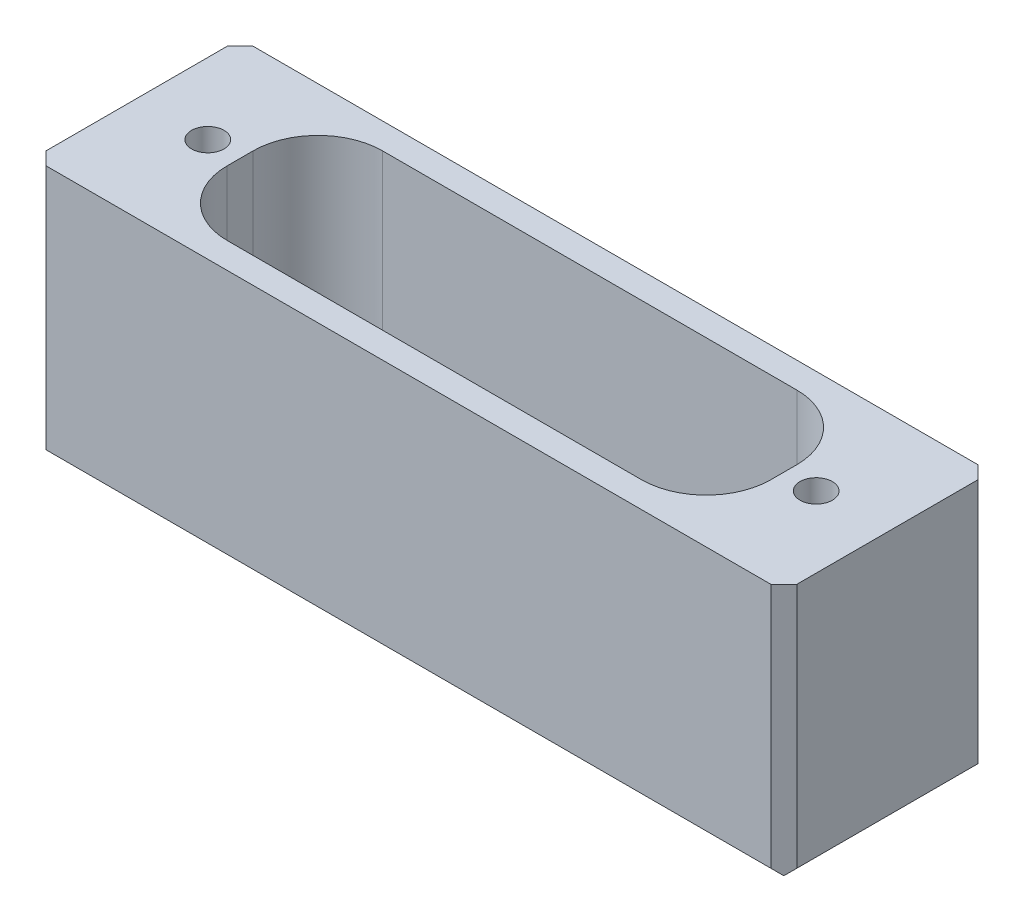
ISO-10303-21;
HEADER;
FILE_DESCRIPTION(('STEP AP214'),'2;1');
FILE_NAME('part.step','',(''),(''),'','','');
FILE_SCHEMA(('AUTOMOTIVE_DESIGN { 1 0 10303 214 1 1 1 1 }'));
ENDSEC;
DATA;
#1=APPLICATION_CONTEXT('core data for automotive mechanical design processes');
#2=APPLICATION_PROTOCOL_DEFINITION('international standard','automotive_design',2000,#1);
#3=PRODUCT_CONTEXT('',#1,'mechanical');
#4=PRODUCT('Part','Part','',(#3));
#5=PRODUCT_RELATED_PRODUCT_CATEGORY('part','',(#4));
#6=PRODUCT_DEFINITION_FORMATION('','',#4);
#7=PRODUCT_DEFINITION_CONTEXT('part definition',#1,'design');
#8=PRODUCT_DEFINITION('design','',#6,#7);
#9=PRODUCT_DEFINITION_SHAPE('','',#8);
#10=(LENGTH_UNIT() NAMED_UNIT(*) SI_UNIT(.MILLI.,.METRE.));
#11=(NAMED_UNIT(*) PLANE_ANGLE_UNIT() SI_UNIT($,.RADIAN.));
#12=(NAMED_UNIT(*) SI_UNIT($,.STERADIAN.) SOLID_ANGLE_UNIT());
#13=UNCERTAINTY_MEASURE_WITH_UNIT(LENGTH_MEASURE(1.E-05),#10,'distance_accuracy_value','');
#14=(GEOMETRIC_REPRESENTATION_CONTEXT(3) GLOBAL_UNCERTAINTY_ASSIGNED_CONTEXT((#13)) GLOBAL_UNIT_ASSIGNED_CONTEXT((#10,
#11,#12)) REPRESENTATION_CONTEXT('',''));
#15=CARTESIAN_POINT('',(0.,0.,0.));
#16=DIRECTION('',(0.,0.,1.));
#17=DIRECTION('',(1.,0.,0.));
#18=AXIS2_PLACEMENT_3D('',#15,#16,#17);
#19=CARTESIAN_POINT('',(8.,0.,-7.));
#20=DIRECTION('',(-1.,0.,0.));
#21=DIRECTION('',(0.,0.,1.));
#22=AXIS2_PLACEMENT_3D('',#19,#20,#21);
#23=PLANE('',#22);
#24=DIRECTION('',(0.,0.,-1.));
#25=VECTOR('',#24,1.);
#26=CARTESIAN_POINT('',(8.,-18.,0.));
#27=LINE('',#26,#25);
#28=CARTESIAN_POINT('',(8.,-18.,-7.));
#29=VERTEX_POINT('',#28);
#30=CARTESIAN_POINT('',(8.,-18.,-9.));
#31=VERTEX_POINT('',#30);
#32=EDGE_CURVE('P0_E172',#29,#31,#27,.T.);
#33=ORIENTED_EDGE('',*,*,#32,.T.);
#34=DIRECTION('',(0.,1.,0.));
#35=VECTOR('',#34,1.);
#36=CARTESIAN_POINT('',(8.,0.,-9.));
#37=LINE('',#36,#35);
#38=CARTESIAN_POINT('',(8.,-16.2912878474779,-9.));
#39=VERTEX_POINT('',#38);
#40=EDGE_CURVE('P0_E168',#39,#31,#37,.F.);
#41=ORIENTED_EDGE('',*,*,#40,.F.);
#42=CARTESIAN_POINT('',(8.,-14.,-8.));
#43=DIRECTION('',(-1.,0.,0.));
#44=DIRECTION('',(0.,0.,1.));
#45=AXIS2_PLACEMENT_3D('',#42,#43,#44);
#46=CIRCLE('',#45,2.5);
#47=CARTESIAN_POINT('',(8.,-16.2912878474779,-7.));
#48=VERTEX_POINT('',#47);
#49=EDGE_CURVE('P0_E19',#39,#48,#46,.T.);
#50=ORIENTED_EDGE('',*,*,#49,.T.);
#51=DIRECTION('',(0.,1.,0.));
#52=VECTOR('',#51,1.);
#53=CARTESIAN_POINT('',(8.,0.,-7.));
#54=LINE('',#53,#52);
#55=EDGE_CURVE('P0_E176',#29,#48,#54,.T.);
#56=ORIENTED_EDGE('',*,*,#55,.F.);
#57=EDGE_LOOP('',(#33,#41,#50,#56));
#58=FACE_BOUND('',#57,.T.);
#59=ADVANCED_FACE('P0_F16',(#58),#23,.F.);
#60=CARTESIAN_POINT('',(58.,-19.,-1.));
#61=DIRECTION('',(-0.707106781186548,0.707106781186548,0.));
#62=DIRECTION('',(-0.707106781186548,-0.707106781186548,0.));
#63=AXIS2_PLACEMENT_3D('',#60,#61,#62);
#64=PLANE('',#63);
#65=DIRECTION('',(0.577350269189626,0.577350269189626,0.577350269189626));
#66=VECTOR('',#65,1.);
#67=CARTESIAN_POINT('',(57.,-20.,-1.));
#68=LINE('',#67,#66);
#69=CARTESIAN_POINT('',(57.,-20.,-0.999999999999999));
#70=VERTEX_POINT('',#69);
#71=CARTESIAN_POINT('',(57.5,-19.5,-0.5));
#72=VERTEX_POINT('',#71);
#73=EDGE_CURVE('P0_E369',#70,#72,#68,.T.);
#74=ORIENTED_EDGE('',*,*,#73,.F.);
#75=DIRECTION('',(0.,0.,-1.));
#76=VECTOR('',#75,1.);
#77=CARTESIAN_POINT('',(57.,-20.,0.));
#78=LINE('',#77,#76);
#79=CARTESIAN_POINT('',(57.,-20.,-15.));
#80=VERTEX_POINT('',#79);
#81=EDGE_CURVE('P0_E328',#80,#70,#78,.F.);
#82=ORIENTED_EDGE('',*,*,#81,.F.);
#83=DIRECTION('',(-0.577350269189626,-0.577350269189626,0.577350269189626));
#84=VECTOR('',#83,1.);
#85=CARTESIAN_POINT('',(57.5,-19.5,-15.5));
#86=LINE('',#85,#84);
#87=CARTESIAN_POINT('',(57.5,-19.5,-15.5));
#88=VERTEX_POINT('',#87);
#89=EDGE_CURVE('P0_E353',#88,#80,#86,.T.);
#90=ORIENTED_EDGE('',*,*,#89,.F.);
#91=DIRECTION('',(0.577350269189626,0.577350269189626,0.577350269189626));
#92=VECTOR('',#91,1.);
#93=CARTESIAN_POINT('',(57.5,-19.5,-15.5));
#94=LINE('',#93,#92);
#95=CARTESIAN_POINT('',(58.,-19.,-15.));
#96=VERTEX_POINT('',#95);
#97=EDGE_CURVE('P0_E363',#88,#96,#94,.T.);
#98=ORIENTED_EDGE('',*,*,#97,.T.);
#99=DIRECTION('',(0.,0.,-1.));
#100=VECTOR('',#99,1.);
#101=CARTESIAN_POINT('',(58.,-19.,0.));
#102=LINE('',#101,#100);
#103=CARTESIAN_POINT('',(58.,-19.,-1.));
#104=VERTEX_POINT('',#103);
#105=EDGE_CURVE('P0_E322',#104,#96,#102,.T.);
#106=ORIENTED_EDGE('',*,*,#105,.F.);
#107=DIRECTION('',(0.577350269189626,0.577350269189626,-0.577350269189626));
#108=VECTOR('',#107,1.);
#109=CARTESIAN_POINT('',(57.5,-19.5,-0.5));
#110=LINE('',#109,#108);
#111=EDGE_CURVE('P0_E367',#72,#104,#110,.T.);
#112=ORIENTED_EDGE('',*,*,#111,.F.);
#113=EDGE_LOOP('',(#74,#82,#90,#98,#106,#112));
#114=FACE_BOUND('',#113,.T.);
#115=ADVANCED_FACE('P0_F454',(#114),#64,.F.);
#116=CARTESIAN_POINT('',(58.,-20.,-15.));
#117=DIRECTION('',(-0.707106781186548,0.,0.707106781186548));
#118=DIRECTION('',(0.707106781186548,0.,0.707106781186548));
#119=AXIS2_PLACEMENT_3D('',#116,#117,#118);
#120=PLANE('',#119);
#121=DIRECTION('',(0.577350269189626,-0.577350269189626,0.577350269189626));
#122=VECTOR('',#121,1.);
#123=CARTESIAN_POINT('',(57.,-19.,-16.));
#124=LINE('',#123,#122);
#125=CARTESIAN_POINT('',(57.,-19.,-16.));
#126=VERTEX_POINT('',#125);
#127=EDGE_CURVE('P0_E360',#126,#88,#124,.T.);
#128=ORIENTED_EDGE('',*,*,#127,.F.);
#129=DIRECTION('',(0.,1.,0.));
#130=VECTOR('',#129,1.);
#131=CARTESIAN_POINT('',(57.,-20.,-16.));
#132=LINE('',#131,#130);
#133=CARTESIAN_POINT('',(57.,0.,-16.));
#134=VERTEX_POINT('',#133);
#135=EDGE_CURVE('P0_E316',#134,#126,#132,.F.);
#136=ORIENTED_EDGE('',*,*,#135,.F.);
#137=DIRECTION('',(0.707106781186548,0.,0.707106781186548));
#138=VECTOR('',#137,1.);
#139=CARTESIAN_POINT('',(58.,0.,-15.));
#140=LINE('',#139,#138);
#141=CARTESIAN_POINT('',(58.,0.,-15.));
#142=VERTEX_POINT('',#141);
#143=EDGE_CURVE('P0_E365',#142,#134,#140,.F.);
#144=ORIENTED_EDGE('',*,*,#143,.F.);
#145=DIRECTION('',(0.,1.,0.));
#146=VECTOR('',#145,1.);
#147=CARTESIAN_POINT('',(58.,0.,-15.));
#148=LINE('',#147,#146);
#149=EDGE_CURVE('P0_E319',#96,#142,#148,.T.);
#150=ORIENTED_EDGE('',*,*,#149,.F.);
#151=ORIENTED_EDGE('',*,*,#97,.F.);
#152=EDGE_LOOP('',(#128,#136,#144,#150,#151));
#153=FACE_BOUND('',#152,.T.);
#154=ADVANCED_FACE('P0_F459',(#153),#120,.F.);
#155=CARTESIAN_POINT('',(1.,-19.,-16.));
#156=DIRECTION('',(0.,-0.707106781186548,-0.707106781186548));
#157=DIRECTION('',(0.,0.707106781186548,-0.707106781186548));
#158=AXIS2_PLACEMENT_3D('',#155,#156,#157);
#159=PLANE('',#158);
#160=DIRECTION('',(-0.577350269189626,-0.577350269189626,0.577350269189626));
#161=VECTOR('',#160,1.);
#162=CARTESIAN_POINT('',(1.,-19.,-16.));
#163=LINE('',#162,#161);
#164=CARTESIAN_POINT('',(1.,-19.,-16.));
#165=VERTEX_POINT('',#164);
#166=CARTESIAN_POINT('',(0.5,-19.5,-15.5));
#167=VERTEX_POINT('',#166);
#168=EDGE_CURVE('P0_E335',#165,#167,#163,.T.);
#169=ORIENTED_EDGE('',*,*,#168,.F.);
#170=DIRECTION('',(-1.,0.,0.));
#171=VECTOR('',#170,1.);
#172=CARTESIAN_POINT('',(0.,-19.,-16.));
#173=LINE('',#172,#171);
#174=EDGE_CURVE('P0_E313',#126,#165,#173,.T.);
#175=ORIENTED_EDGE('',*,*,#174,.F.);
#176=ORIENTED_EDGE('',*,*,#127,.T.);
#177=ORIENTED_EDGE('',*,*,#89,.T.);
#178=DIRECTION('',(1.,0.,0.));
#179=VECTOR('',#178,1.);
#180=CARTESIAN_POINT('',(0.,-20.,-15.));
#181=LINE('',#180,#179);
#182=CARTESIAN_POINT('',(1.,-20.,-15.));
#183=VERTEX_POINT('',#182);
#184=EDGE_CURVE('P0_E184',#183,#80,#181,.T.);
#185=ORIENTED_EDGE('',*,*,#184,.F.);
#186=DIRECTION('',(0.577350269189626,-0.577350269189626,0.577350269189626));
#187=VECTOR('',#186,1.);
#188=CARTESIAN_POINT('',(0.5,-19.5,-15.5));
#189=LINE('',#188,#187);
#190=EDGE_CURVE('P0_E345',#167,#183,#189,.T.);
#191=ORIENTED_EDGE('',*,*,#190,.F.);
#192=EDGE_LOOP('',(#169,#175,#176,#177,#185,#191));
#193=FACE_BOUND('',#192,.T.);
#194=ADVANCED_FACE('P0_F479',(#193),#159,.T.);
#195=CARTESIAN_POINT('',(52.5,-10.0000000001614,-8.));
#196=DIRECTION('',(0.,1.,0.));
#197=DIRECTION('',(0.,0.,1.));
#198=AXIS2_PLACEMENT_3D('',#195,#196,#197);
#199=CONICAL_SURFACE('',#198,1.24999999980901,1.04719755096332);
#200=CARTESIAN_POINT('',(52.4999999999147,-10.7216878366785,-8.));
#201=VERTEX_POINT('',#200);
#202=VERTEX_LOOP('',#201);
#203=FACE_BOUND('',#202,.T.);
#204=CARTESIAN_POINT('',(52.5,-10.,-8.));
#205=DIRECTION('',(0.,1.,0.));
#206=DIRECTION('',(0.,0.,1.));
#207=AXIS2_PLACEMENT_3D('',#204,#205,#206);
#208=CIRCLE('',#207,1.25);
#209=CARTESIAN_POINT('',(52.5,-10.,-6.75));
#210=VERTEX_POINT('',#209);
#211=EDGE_CURVE('P0_E312',#210,#210,#208,.T.);
#212=ORIENTED_EDGE('',*,*,#211,.T.);
#213=EDGE_LOOP('',(#212));
#214=FACE_BOUND('',#213,.T.);
#215=ADVANCED_FACE('P0_F497',(#203,#214),#199,.F.);
#216=CARTESIAN_POINT('',(0.,-18.,0.));
#217=DIRECTION('',(0.,-1.,0.));
#218=DIRECTION('',(0.,0.,-1.));
#219=AXIS2_PLACEMENT_3D('',#216,#217,#218);
#220=PLANE('',#219);
#221=CARTESIAN_POINT('',(45.,-18.,-7.));
#222=DIRECTION('',(0.,-1.,0.));
#223=DIRECTION('',(0.,0.,-1.));
#224=AXIS2_PLACEMENT_3D('',#221,#222,#223);
#225=CIRCLE('',#224,5.);
#226=CARTESIAN_POINT('',(45.,-18.,-2.));
#227=VERTEX_POINT('',#226);
#228=CARTESIAN_POINT('',(50.,-18.,-7.));
#229=VERTEX_POINT('',#228);
#230=EDGE_CURVE('P0_E285',#227,#229,#225,.F.);
#231=ORIENTED_EDGE('',*,*,#230,.T.);
#232=DIRECTION('',(0.,0.,-1.));
#233=VECTOR('',#232,1.);
#234=CARTESIAN_POINT('',(50.,-18.,-9.));
#235=LINE('',#234,#233);
#236=CARTESIAN_POINT('',(50.,-18.,-9.));
#237=VERTEX_POINT('',#236);
#238=EDGE_CURVE('P0_E294',#229,#237,#235,.T.);
#239=ORIENTED_EDGE('',*,*,#238,.T.);
#240=CARTESIAN_POINT('',(45.,-18.,-9.));
#241=DIRECTION('',(0.,-1.,0.));
#242=DIRECTION('',(0.,0.,-1.));
#243=AXIS2_PLACEMENT_3D('',#240,#241,#242);
#244=CIRCLE('',#243,5.);
#245=CARTESIAN_POINT('',(45.,-18.,-14.));
#246=VERTEX_POINT('',#245);
#247=EDGE_CURVE('P0_E202',#237,#246,#244,.F.);
#248=ORIENTED_EDGE('',*,*,#247,.T.);
#249=DIRECTION('',(-1.,0.,0.));
#250=VECTOR('',#249,1.);
#251=CARTESIAN_POINT('',(13.,-18.,-14.));
#252=LINE('',#251,#250);
#253=CARTESIAN_POINT('',(13.,-18.,-14.));
#254=VERTEX_POINT('',#253);
#255=EDGE_CURVE('P0_E193',#246,#254,#252,.T.);
#256=ORIENTED_EDGE('',*,*,#255,.T.);
#257=CARTESIAN_POINT('',(13.,-18.,-9.));
#258=DIRECTION('',(0.,-1.,0.));
#259=DIRECTION('',(0.,0.,-1.));
#260=AXIS2_PLACEMENT_3D('',#257,#258,#259);
#261=CIRCLE('',#260,5.);
#262=EDGE_CURVE('P0_E191',#254,#31,#261,.F.);
#263=ORIENTED_EDGE('',*,*,#262,.T.);
#264=ORIENTED_EDGE('',*,*,#32,.F.);
#265=CARTESIAN_POINT('',(13.,-18.,-7.));
#266=DIRECTION('',(0.,-1.,0.));
#267=DIRECTION('',(0.,0.,-1.));
#268=AXIS2_PLACEMENT_3D('',#265,#266,#267);
#269=CIRCLE('',#268,5.);
#270=CARTESIAN_POINT('',(13.,-18.,-2.));
#271=VERTEX_POINT('',#270);
#272=EDGE_CURVE('P0_E282',#29,#271,#269,.F.);
#273=ORIENTED_EDGE('',*,*,#272,.T.);
#274=DIRECTION('',(1.,0.,0.));
#275=VECTOR('',#274,1.);
#276=CARTESIAN_POINT('',(45.,-18.,-2.));
#277=LINE('',#276,#275);
#278=EDGE_CURVE('P0_E287',#271,#227,#277,.T.);
#279=ORIENTED_EDGE('',*,*,#278,.T.);
#280=EDGE_LOOP('',(#231,#239,#248,#256,#263,#264,#273,#279));
#281=FACE_BOUND('',#280,.T.);
#282=ADVANCED_FACE('P0_F420',(#281),#220,.F.);
#283=CARTESIAN_POINT('',(5.5,-10.0000000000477,-8.));
#284=DIRECTION('',(0.,1.,0.));
#285=DIRECTION('',(0.,0.,1.));
#286=AXIS2_PLACEMENT_3D('',#283,#284,#285);
#287=CONICAL_SURFACE('',#286,1.24999999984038,1.04719755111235);
#288=CARTESIAN_POINT('',(5.49999999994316,-10.7216878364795,-8.));
#289=VERTEX_POINT('',#288);
#290=VERTEX_LOOP('',#289);
#291=FACE_BOUND('',#290,.T.);
#292=CARTESIAN_POINT('',(5.5,-10.,-8.));
#293=DIRECTION('',(0.,1.,0.));
#294=DIRECTION('',(0.,0.,1.));
#295=AXIS2_PLACEMENT_3D('',#292,#293,#294);
#296=CIRCLE('',#295,1.25);
#297=CARTESIAN_POINT('',(5.5,-10.,-6.75));
#298=VERTEX_POINT('',#297);
#299=EDGE_CURVE('P0_E348',#298,#298,#296,.T.);
#300=ORIENTED_EDGE('',*,*,#299,.T.);
#301=EDGE_LOOP('',(#300));
#302=FACE_BOUND('',#301,.T.);
#303=ADVANCED_FACE('P0_F489',(#291,#302),#287,.F.);
#304=CARTESIAN_POINT('',(0.,-19.,-1.));
#305=DIRECTION('',(-0.707106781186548,-0.707106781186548,0.));
#306=DIRECTION('',(0.707106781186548,-0.707106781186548,0.));
#307=AXIS2_PLACEMENT_3D('',#304,#305,#306);
#308=PLANE('',#307);
#309=DIRECTION('',(-0.577350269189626,0.577350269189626,-0.577350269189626));
#310=VECTOR('',#309,1.);
#311=CARTESIAN_POINT('',(0.5,-19.5,-0.5));
#312=LINE('',#311,#310);
#313=CARTESIAN_POINT('',(0.5,-19.5,-0.5));
#314=VERTEX_POINT('',#313);
#315=CARTESIAN_POINT('',(0.,-19.,-1.));
#316=VERTEX_POINT('',#315);
#317=EDGE_CURVE('P0_E340',#314,#316,#312,.T.);
#318=ORIENTED_EDGE('',*,*,#317,.T.);
#319=DIRECTION('',(0.,0.,-1.));
#320=VECTOR('',#319,1.);
#321=CARTESIAN_POINT('',(0.,-19.,0.));
#322=LINE('',#321,#320);
#323=CARTESIAN_POINT('',(0.,-19.,-15.));
#324=VERTEX_POINT('',#323);
#325=EDGE_CURVE('P0_E350',#316,#324,#322,.T.);
#326=ORIENTED_EDGE('',*,*,#325,.T.);
#327=DIRECTION('',(-0.577350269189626,0.577350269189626,0.577350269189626));
#328=VECTOR('',#327,1.);
#329=CARTESIAN_POINT('',(0.5,-19.5,-15.5));
#330=LINE('',#329,#328);
#331=EDGE_CURVE('P0_E185',#167,#324,#330,.T.);
#332=ORIENTED_EDGE('',*,*,#331,.F.);
#333=ORIENTED_EDGE('',*,*,#190,.T.);
#334=DIRECTION('',(0.,0.,-1.));
#335=VECTOR('',#334,1.);
#336=CARTESIAN_POINT('',(1.,-20.,0.));
#337=LINE('',#336,#335);
#338=CARTESIAN_POINT('',(1.,-20.,-1.));
#339=VERTEX_POINT('',#338);
#340=EDGE_CURVE('P0_E325',#339,#183,#337,.T.);
#341=ORIENTED_EDGE('',*,*,#340,.F.);
#342=DIRECTION('',(-0.577350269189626,0.577350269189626,0.577350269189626));
#343=VECTOR('',#342,1.);
#344=CARTESIAN_POINT('',(1.,-20.,-1.));
#345=LINE('',#344,#343);
#346=EDGE_CURVE('P0_E342',#339,#314,#345,.T.);
#347=ORIENTED_EDGE('',*,*,#346,.T.);
#348=EDGE_LOOP('',(#318,#326,#332,#333,#341,#347));
#349=FACE_BOUND('',#348,.T.);
#350=ADVANCED_FACE('P0_F475',(#349),#308,.T.);
#351=CARTESIAN_POINT('',(0.,-20.,-15.));
#352=DIRECTION('',(-0.707106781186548,0.,-0.707106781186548));
#353=DIRECTION('',(-0.707106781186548,0.,0.707106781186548));
#354=AXIS2_PLACEMENT_3D('',#351,#352,#353);
#355=PLANE('',#354);
#356=ORIENTED_EDGE('',*,*,#331,.T.);
#357=DIRECTION('',(0.,1.,0.));
#358=VECTOR('',#357,1.);
#359=CARTESIAN_POINT('',(0.,0.,-15.));
#360=LINE('',#359,#358);
#361=CARTESIAN_POINT('',(0.,0.,-15.));
#362=VERTEX_POINT('',#361);
#363=EDGE_CURVE('P0_E399',#324,#362,#360,.T.);
#364=ORIENTED_EDGE('',*,*,#363,.T.);
#365=DIRECTION('',(-0.707106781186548,0.,0.707106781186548));
#366=VECTOR('',#365,1.);
#367=CARTESIAN_POINT('',(0.,0.,-15.));
#368=LINE('',#367,#366);
#369=CARTESIAN_POINT('',(1.,0.,-16.));
#370=VERTEX_POINT('',#369);
#371=EDGE_CURVE('P0_E338',#362,#370,#368,.F.);
#372=ORIENTED_EDGE('',*,*,#371,.T.);
#373=DIRECTION('',(0.,1.,0.));
#374=VECTOR('',#373,1.);
#375=CARTESIAN_POINT('',(1.,-20.,-16.));
#376=LINE('',#375,#374);
#377=EDGE_CURVE('P0_E309',#165,#370,#376,.T.);
#378=ORIENTED_EDGE('',*,*,#377,.F.);
#379=ORIENTED_EDGE('',*,*,#168,.T.);
#380=EDGE_LOOP('',(#356,#364,#372,#378,#379));
#381=FACE_BOUND('',#380,.T.);
#382=ADVANCED_FACE('P0_F235',(#381),#355,.T.);
#383=CARTESIAN_POINT('',(0.,-14.,-8.));
#384=DIRECTION('',(-1.,0.,0.));
#385=DIRECTION('',(0.,0.,1.));
#386=AXIS2_PLACEMENT_3D('',#383,#384,#385);
#387=CYLINDRICAL_SURFACE('',#386,2.5);
#388=CARTESIAN_POINT('',(0.,-14.,-8.));
#389=DIRECTION('',(-1.,0.,0.));
#390=DIRECTION('',(0.,0.,1.));
#391=AXIS2_PLACEMENT_3D('',#388,#389,#390);
#392=CIRCLE('',#391,2.5);
#393=CARTESIAN_POINT('',(0.,-14.,-5.5));
#394=VERTEX_POINT('',#393);
#395=EDGE_CURVE('P0_E396',#394,#394,#392,.T.);
#396=ORIENTED_EDGE('',*,*,#395,.T.);
#397=EDGE_LOOP('',(#396));
#398=FACE_BOUND('',#397,.T.);
#399=CARTESIAN_POINT('',(8.,-16.2912878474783,-8.99999999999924));
#400=CARTESIAN_POINT('',(7.9999922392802,-16.2637435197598,-9.06313467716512));
#401=CARTESIAN_POINT('',(8.00119561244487,-16.2335796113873,-9.12510982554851));
#402=CARTESIAN_POINT('',(8.00570320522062,-16.1682973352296,-9.24627781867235));
#403=CARTESIAN_POINT('',(8.00900643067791,-16.133181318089,-9.30547196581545));
#404=CARTESIAN_POINT('',(8.01738065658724,-16.0583623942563,-9.42050700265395));
#405=CARTESIAN_POINT('',(8.02244646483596,-16.0186731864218,-9.47635718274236));
#406=CARTESIAN_POINT('',(8.03398560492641,-15.93493797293,-9.58451831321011));
#407=CARTESIAN_POINT('',(8.04045907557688,-15.8908915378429,-9.63682891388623));
#408=CARTESIAN_POINT('',(8.06141124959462,-15.7527995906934,-9.78780391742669));
#409=CARTESIAN_POINT('',(8.07744401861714,-15.6526293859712,-9.88077499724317));
#410=CARTESIAN_POINT('',(8.11055824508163,-15.4385688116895,-10.0491733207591));
#411=CARTESIAN_POINT('',(8.12764081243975,-15.3246637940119,-10.1245815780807));
#412=CARTESIAN_POINT('',(8.16044628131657,-15.0814150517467,-10.2584321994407));
#413=CARTESIAN_POINT('',(8.17609482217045,-14.9516542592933,-10.3161378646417));
#414=CARTESIAN_POINT('',(8.20232352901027,-14.6839405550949,-10.4087779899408));
#415=CARTESIAN_POINT('',(8.21291384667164,-14.5460046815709,-10.4437581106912));
#416=CARTESIAN_POINT('',(8.22338018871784,-14.3390295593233,-10.4778404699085));
#417=CARTESIAN_POINT('',(8.22596374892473,-14.2715283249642,-10.4861401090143));
#418=CARTESIAN_POINT('',(8.22942775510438,-14.1360295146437,-10.4972218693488));
#419=CARTESIAN_POINT('',(8.23030817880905,-14.0680319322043,-10.5000039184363));
#420=CARTESIAN_POINT('',(8.23029553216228,-13.8624902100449,-10.4999920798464));
#421=CARTESIAN_POINT('',(8.22667302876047,-13.724840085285,-10.4886021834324));
#422=CARTESIAN_POINT('',(8.21282218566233,-13.4534742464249,-10.4434189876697));
#423=CARTESIAN_POINT('',(8.20258277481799,-13.3197655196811,-10.4095881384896));
#424=CARTESIAN_POINT('',(8.17737856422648,-13.0604472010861,-10.3207701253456));
#425=CARTESIAN_POINT('',(8.162425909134,-12.9348177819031,-10.265837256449));
#426=CARTESIAN_POINT('',(8.13038921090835,-12.694393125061,-10.13636208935));
#427=CARTESIAN_POINT('',(8.11330467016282,-12.5796004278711,-10.0618152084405));
#428=CARTESIAN_POINT('',(8.07949404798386,-12.3602527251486,-9.89236228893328));
#429=CARTESIAN_POINT('',(8.06279551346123,-12.2561256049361,-9.7968965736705));
#430=CARTESIAN_POINT('',(8.03377581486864,-12.0652461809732,-9.58950190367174));
#431=CARTESIAN_POINT('',(8.02144763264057,-11.9784661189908,-9.47759975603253));
#432=CARTESIAN_POINT('',(8.00880113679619,-11.8647346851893,-9.30203006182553));
#433=CARTESIAN_POINT('',(8.00557000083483,-11.8300906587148,-9.24343324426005));
#434=CARTESIAN_POINT('',(8.00116820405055,-11.7656932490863,-9.12360723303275));
#435=CARTESIAN_POINT('',(7.99999568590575,-11.7359354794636,-9.06238046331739));
#436=CARTESIAN_POINT('',(8.,-11.7087121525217,-8.99999999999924));
#437=B_SPLINE_CURVE_WITH_KNOTS('',3,(#399,#400,#401,#402,#403,#404,#405,#406,#407,#408,#409,
#410,#411,#412,#413,#414,#415,#416,#417,#418,#419,#420,#421,#422,#423,#424,#425,#426,#427,#428,
#429,#430,#431,#432,#433,#434,#435,#436),.UNSPECIFIED.,.F.,.F.,(4,2,2,2,2,2,2,2,2,2,2,2,2,2,2,2,
2,2,4),(0.,0.206552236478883,0.413006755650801,0.618858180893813,0.824729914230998,
1.23553865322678,1.64678945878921,2.07336091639,2.49907262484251,2.70303573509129,
2.90700151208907,3.31926807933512,3.73222622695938,4.14412888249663,4.55612786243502,
4.98090358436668,5.40499405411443,5.60921647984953,5.81325455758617),.UNSPECIFIED.);
#438=CARTESIAN_POINT('',(8.,-11.7087121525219,-8.99999999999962));
#439=VERTEX_POINT('',#438);
#440=EDGE_CURVE('P0_E181',#39,#439,#437,.T.);
#441=ORIENTED_EDGE('',*,*,#440,.T.);
#442=CARTESIAN_POINT('',(8.,-14.,-8.));
#443=DIRECTION('',(-1.,0.,0.));
#444=DIRECTION('',(0.,0.,1.));
#445=AXIS2_PLACEMENT_3D('',#442,#443,#444);
#446=CIRCLE('',#445,2.5);
#447=CARTESIAN_POINT('',(8.,-11.7087121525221,-7.));
#448=VERTEX_POINT('',#447);
#449=EDGE_CURVE('P0_E308',#439,#448,#446,.F.);
#450=ORIENTED_EDGE('',*,*,#449,.T.);
#451=CARTESIAN_POINT('',(8.,-11.7087121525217,-7.00000000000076));
#452=CARTESIAN_POINT('',(7.9999922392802,-11.7362564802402,-6.93686532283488));
#453=CARTESIAN_POINT('',(8.00119561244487,-11.7664203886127,-6.8748901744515));
#454=CARTESIAN_POINT('',(8.00570320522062,-11.8317026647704,-6.75372218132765));
#455=CARTESIAN_POINT('',(8.00900643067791,-11.866818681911,-6.69452803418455));
#456=CARTESIAN_POINT('',(8.01738065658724,-11.9416376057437,-6.57949299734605));
#457=CARTESIAN_POINT('',(8.02244646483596,-11.9813268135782,-6.52364281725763));
#458=CARTESIAN_POINT('',(8.03398560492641,-12.06506202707,-6.41548168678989));
#459=CARTESIAN_POINT('',(8.04045907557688,-12.1091084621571,-6.36317108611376));
#460=CARTESIAN_POINT('',(8.06141124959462,-12.2472004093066,-6.21219608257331));
#461=CARTESIAN_POINT('',(8.07744401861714,-12.3473706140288,-6.11922500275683));
#462=CARTESIAN_POINT('',(8.11055824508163,-12.5614311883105,-5.95082667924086));
#463=CARTESIAN_POINT('',(8.12764081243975,-12.6753362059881,-5.87541842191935));
#464=CARTESIAN_POINT('',(8.16044628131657,-12.9185849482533,-5.74156780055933));
#465=CARTESIAN_POINT('',(8.17609482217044,-13.0483457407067,-5.6838621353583));
#466=CARTESIAN_POINT('',(8.20232352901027,-13.3160594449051,-5.59122201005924));
#467=CARTESIAN_POINT('',(8.21291384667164,-13.4539953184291,-5.55624188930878));
#468=CARTESIAN_POINT('',(8.22338018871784,-13.6609704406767,-5.52215953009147));
#469=CARTESIAN_POINT('',(8.22596374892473,-13.7284716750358,-5.51385989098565));
#470=CARTESIAN_POINT('',(8.22942775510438,-13.8639704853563,-5.50277813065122));
#471=CARTESIAN_POINT('',(8.23030817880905,-13.9319680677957,-5.49999608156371));
#472=CARTESIAN_POINT('',(8.23029553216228,-14.1375097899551,-5.50000792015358));
#473=CARTESIAN_POINT('',(8.22667302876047,-14.275159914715,-5.51139781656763));
#474=CARTESIAN_POINT('',(8.21282218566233,-14.5465257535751,-5.55658101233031));
#475=CARTESIAN_POINT('',(8.20258277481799,-14.6802344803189,-5.59041186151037));
#476=CARTESIAN_POINT('',(8.17737856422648,-14.9395527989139,-5.67922987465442));
#477=CARTESIAN_POINT('',(8.162425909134,-15.0651822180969,-5.73416274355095));
#478=CARTESIAN_POINT('',(8.13038921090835,-15.305606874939,-5.86363791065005));
#479=CARTESIAN_POINT('',(8.11330467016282,-15.4203995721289,-5.9381847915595));
#480=CARTESIAN_POINT('',(8.07949404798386,-15.6397472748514,-6.10763771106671));
#481=CARTESIAN_POINT('',(8.06279551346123,-15.7438743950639,-6.2031034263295));
#482=CARTESIAN_POINT('',(8.03377581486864,-15.9347538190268,-6.41049809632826));
#483=CARTESIAN_POINT('',(8.02144763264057,-16.0215338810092,-6.52240024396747));
#484=CARTESIAN_POINT('',(8.00880113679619,-16.1352653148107,-6.69796993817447));
#485=CARTESIAN_POINT('',(8.00557000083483,-16.1699093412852,-6.75656675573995));
#486=CARTESIAN_POINT('',(8.00116820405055,-16.2343067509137,-6.87639276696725));
#487=CARTESIAN_POINT('',(7.99999568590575,-16.2640645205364,-6.93761953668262));
#488=CARTESIAN_POINT('',(8.,-16.2912878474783,-7.00000000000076));
#489=B_SPLINE_CURVE_WITH_KNOTS('',3,(#451,#452,#453,#454,#455,#456,#457,#458,#459,#460,#461,
#462,#463,#464,#465,#466,#467,#468,#469,#470,#471,#472,#473,#474,#475,#476,#477,#478,#479,#480,
#481,#482,#483,#484,#485,#486,#487,#488),.UNSPECIFIED.,.F.,.F.,(4,2,2,2,2,2,2,2,2,2,2,2,2,2,2,2,
2,2,4),(0.,0.206552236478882,0.413006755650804,0.618858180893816,0.824729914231,
1.23553865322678,1.64678945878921,2.07336091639,2.49907262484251,2.70303573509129,
2.90700151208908,3.31926807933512,3.73222622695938,4.14412888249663,4.55612786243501,
4.98090358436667,5.40499405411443,5.60921647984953,5.81325455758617),.UNSPECIFIED.);
#490=EDGE_CURVE('P0_E183',#448,#48,#489,.T.);
#491=ORIENTED_EDGE('',*,*,#490,.T.);
#492=ORIENTED_EDGE('',*,*,#49,.F.);
#493=EDGE_LOOP('',(#441,#450,#491,#492));
#494=FACE_BOUND('',#493,.T.);
#495=ADVANCED_FACE('P0_F179',(#398,#494),#387,.F.);
#496=CARTESIAN_POINT('',(0.,-20.,0.));
#497=DIRECTION('',(0.,-1.,0.));
#498=DIRECTION('',(0.,0.,-1.));
#499=AXIS2_PLACEMENT_3D('',#496,#497,#498);
#500=PLANE('',#499);
#501=DIRECTION('',(1.,0.,0.));
#502=VECTOR('',#501,1.);
#503=CARTESIAN_POINT('',(0.,-20.,-1.));
#504=LINE('',#503,#502);
#505=EDGE_CURVE('P0_E398',#339,#70,#504,.T.);
#506=ORIENTED_EDGE('',*,*,#505,.F.);
#507=ORIENTED_EDGE('',*,*,#340,.T.);
#508=ORIENTED_EDGE('',*,*,#184,.T.);
#509=ORIENTED_EDGE('',*,*,#81,.T.);
#510=EDGE_LOOP('',(#506,#507,#508,#509));
#511=FACE_BOUND('',#510,.T.);
#512=ADVANCED_FACE('P0_F227',(#511),#500,.T.);
#513=CARTESIAN_POINT('',(58.,0.,0.));
#514=DIRECTION('',(1.,0.,0.));
#515=DIRECTION('',(0.,0.,-1.));
#516=AXIS2_PLACEMENT_3D('',#513,#514,#515);
#517=PLANE('',#516);
#518=DIRECTION('',(0.,0.,1.));
#519=VECTOR('',#518,1.);
#520=CARTESIAN_POINT('',(58.,0.,-16.));
#521=LINE('',#520,#519);
#522=CARTESIAN_POINT('',(58.,0.,-1.));
#523=VERTEX_POINT('',#522);
#524=EDGE_CURVE('P0_E440',#523,#142,#521,.F.);
#525=ORIENTED_EDGE('',*,*,#524,.F.);
#526=DIRECTION('',(0.,1.,0.));
#527=VECTOR('',#526,1.);
#528=CARTESIAN_POINT('',(58.,0.,-1.));
#529=LINE('',#528,#527);
#530=EDGE_CURVE('P0_E402',#523,#104,#529,.F.);
#531=ORIENTED_EDGE('',*,*,#530,.T.);
#532=ORIENTED_EDGE('',*,*,#105,.T.);
#533=ORIENTED_EDGE('',*,*,#149,.T.);
#534=EDGE_LOOP('',(#525,#531,#532,#533));
#535=FACE_BOUND('',#534,.T.);
#536=ADVANCED_FACE('P0_F224',(#535),#517,.T.);
#537=CARTESIAN_POINT('',(0.,-20.,-16.));
#538=DIRECTION('',(0.,0.,-1.));
#539=DIRECTION('',(-1.,0.,0.));
#540=AXIS2_PLACEMENT_3D('',#537,#538,#539);
#541=PLANE('',#540);
#542=ORIENTED_EDGE('',*,*,#174,.T.);
#543=ORIENTED_EDGE('',*,*,#377,.T.);
#544=DIRECTION('',(1.,0.,0.));
#545=VECTOR('',#544,1.);
#546=CARTESIAN_POINT('',(0.,0.,-16.));
#547=LINE('',#546,#545);
#548=EDGE_CURVE('P0_E437',#134,#370,#547,.F.);
#549=ORIENTED_EDGE('',*,*,#548,.F.);
#550=ORIENTED_EDGE('',*,*,#135,.T.);
#551=EDGE_LOOP('',(#542,#543,#549,#550));
#552=FACE_BOUND('',#551,.T.);
#553=ADVANCED_FACE('P0_F220',(#552),#541,.T.);
#554=CARTESIAN_POINT('',(52.5,-11.25777222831,-8.));
#555=DIRECTION('',(0.,1.,0.));
#556=DIRECTION('',(0.,0.,1.));
#557=AXIS2_PLACEMENT_3D('',#554,#555,#556);
#558=CYLINDRICAL_SURFACE('',#557,1.25);
#559=ORIENTED_EDGE('',*,*,#211,.F.);
#560=EDGE_LOOP('',(#559));
#561=FACE_BOUND('',#560,.T.);
#562=CARTESIAN_POINT('',(52.5,0.,-8.));
#563=DIRECTION('',(0.,1.,0.));
#564=DIRECTION('',(0.,0.,1.));
#565=AXIS2_PLACEMENT_3D('',#562,#563,#564);
#566=CIRCLE('',#565,1.25);
#567=CARTESIAN_POINT('',(52.5,0.,-6.75));
#568=VERTEX_POINT('',#567);
#569=EDGE_CURVE('P0_E393',#568,#568,#566,.F.);
#570=ORIENTED_EDGE('',*,*,#569,.F.);
#571=EDGE_LOOP('',(#570));
#572=FACE_BOUND('',#571,.T.);
#573=ADVANCED_FACE('P0_F216',(#561,#572),#558,.F.);
#574=CARTESIAN_POINT('',(8.,0.,-7.));
#575=DIRECTION('',(-1.,0.,0.));
#576=DIRECTION('',(0.,0.,1.));
#577=AXIS2_PLACEMENT_3D('',#574,#575,#576);
#578=PLANE('',#577);
#579=DIRECTION('',(0.,0.,1.));
#580=VECTOR('',#579,1.);
#581=CARTESIAN_POINT('',(8.,0.,-16.));
#582=LINE('',#581,#580);
#583=CARTESIAN_POINT('',(8.,0.,-7.));
#584=VERTEX_POINT('',#583);
#585=CARTESIAN_POINT('',(8.,0.,-9.));
#586=VERTEX_POINT('',#585);
#587=EDGE_CURVE('P0_E392',#584,#586,#582,.F.);
#588=ORIENTED_EDGE('',*,*,#587,.F.);
#589=DIRECTION('',(0.,-1.,0.));
#590=VECTOR('',#589,1.);
#591=CARTESIAN_POINT('',(8.,0.,-7.));
#592=LINE('',#591,#590);
#593=EDGE_CURVE('P0_E351',#584,#448,#592,.T.);
#594=ORIENTED_EDGE('',*,*,#593,.T.);
#595=ORIENTED_EDGE('',*,*,#449,.F.);
#596=DIRECTION('',(0.,-1.,0.));
#597=VECTOR('',#596,1.);
#598=CARTESIAN_POINT('',(8.,0.,-9.));
#599=LINE('',#598,#597);
#600=EDGE_CURVE('P0_E189',#439,#586,#599,.F.);
#601=ORIENTED_EDGE('',*,*,#600,.T.);
#602=EDGE_LOOP('',(#588,#594,#595,#601));
#603=FACE_BOUND('',#602,.T.);
#604=ADVANCED_FACE('P0_F212',(#603),#578,.F.);
#605=CARTESIAN_POINT('',(13.,0.,-9.));
#606=DIRECTION('',(0.,-1.,0.));
#607=DIRECTION('',(0.,0.,-1.));
#608=AXIS2_PLACEMENT_3D('',#605,#606,#607);
#609=CYLINDRICAL_SURFACE('',#608,5.);
#610=ORIENTED_EDGE('',*,*,#40,.T.);
#611=ORIENTED_EDGE('',*,*,#262,.F.);
#612=DIRECTION('',(0.,1.,0.));
#613=VECTOR('',#612,1.);
#614=CARTESIAN_POINT('',(13.,0.,-14.));
#615=LINE('',#614,#613);
#616=CARTESIAN_POINT('',(13.,0.,-14.));
#617=VERTEX_POINT('',#616);
#618=EDGE_CURVE('P0_E190',#254,#617,#615,.T.);
#619=ORIENTED_EDGE('',*,*,#618,.T.);
#620=CARTESIAN_POINT('',(13.,0.,-9.));
#621=DIRECTION('',(0.,-1.,0.));
#622=DIRECTION('',(0.,0.,-1.));
#623=AXIS2_PLACEMENT_3D('',#620,#621,#622);
#624=CIRCLE('',#623,5.);
#625=EDGE_CURVE('P0_E389',#586,#617,#624,.T.);
#626=ORIENTED_EDGE('',*,*,#625,.F.);
#627=ORIENTED_EDGE('',*,*,#600,.F.);
#628=ORIENTED_EDGE('',*,*,#440,.F.);
#629=EDGE_LOOP('',(#610,#611,#619,#626,#627,#628));
#630=FACE_BOUND('',#629,.T.);
#631=ADVANCED_FACE('P0_F187',(#630),#609,.F.);
#632=CARTESIAN_POINT('',(13.,0.,-14.));
#633=DIRECTION('',(0.,0.,-1.));
#634=DIRECTION('',(-1.,0.,0.));
#635=AXIS2_PLACEMENT_3D('',#632,#633,#634);
#636=PLANE('',#635);
#637=DIRECTION('',(0.,-1.,0.));
#638=VECTOR('',#637,1.);
#639=CARTESIAN_POINT('',(45.,0.,-14.));
#640=LINE('',#639,#638);
#641=CARTESIAN_POINT('',(45.,0.,-14.));
#642=VERTEX_POINT('',#641);
#643=EDGE_CURVE('P0_E305',#246,#642,#640,.F.);
#644=ORIENTED_EDGE('',*,*,#643,.T.);
#645=DIRECTION('',(1.,0.,0.));
#646=VECTOR('',#645,1.);
#647=CARTESIAN_POINT('',(0.,0.,-14.));
#648=LINE('',#647,#646);
#649=EDGE_CURVE('P0_E388',#617,#642,#648,.T.);
#650=ORIENTED_EDGE('',*,*,#649,.F.);
#651=ORIENTED_EDGE('',*,*,#618,.F.);
#652=ORIENTED_EDGE('',*,*,#255,.F.);
#653=EDGE_LOOP('',(#644,#650,#651,#652));
#654=FACE_BOUND('',#653,.T.);
#655=ADVANCED_FACE('P0_F211',(#654),#636,.F.);
#656=CARTESIAN_POINT('',(45.,0.,-9.));
#657=DIRECTION('',(0.,-1.,0.));
#658=DIRECTION('',(0.,0.,-1.));
#659=AXIS2_PLACEMENT_3D('',#656,#657,#658);
#660=CYLINDRICAL_SURFACE('',#659,5.);
#661=DIRECTION('',(0.,1.,0.));
#662=VECTOR('',#661,1.);
#663=CARTESIAN_POINT('',(50.,0.,-9.));
#664=LINE('',#663,#662);
#665=CARTESIAN_POINT('',(50.,0.,-9.));
#666=VERTEX_POINT('',#665);
#667=EDGE_CURVE('P0_E299',#237,#666,#664,.T.);
#668=ORIENTED_EDGE('',*,*,#667,.T.);
#669=CARTESIAN_POINT('',(45.,0.,-9.));
#670=DIRECTION('',(0.,-1.,0.));
#671=DIRECTION('',(0.,0.,-1.));
#672=AXIS2_PLACEMENT_3D('',#669,#670,#671);
#673=CIRCLE('',#672,5.);
#674=EDGE_CURVE('P0_E385',#642,#666,#673,.T.);
#675=ORIENTED_EDGE('',*,*,#674,.F.);
#676=ORIENTED_EDGE('',*,*,#643,.F.);
#677=ORIENTED_EDGE('',*,*,#247,.F.);
#678=EDGE_LOOP('',(#668,#675,#676,#677));
#679=FACE_BOUND('',#678,.T.);
#680=ADVANCED_FACE('P0_F608',(#679),#660,.F.);
#681=CARTESIAN_POINT('',(50.,0.,-9.));
#682=DIRECTION('',(1.,0.,0.));
#683=DIRECTION('',(0.,0.,-1.));
#684=AXIS2_PLACEMENT_3D('',#681,#682,#683);
#685=PLANE('',#684);
#686=DIRECTION('',(0.,-1.,0.));
#687=VECTOR('',#686,1.);
#688=CARTESIAN_POINT('',(50.,0.,-7.));
#689=LINE('',#688,#687);
#690=CARTESIAN_POINT('',(50.,0.,-7.));
#691=VERTEX_POINT('',#690);
#692=EDGE_CURVE('P0_E288',#229,#691,#689,.F.);
#693=ORIENTED_EDGE('',*,*,#692,.T.);
#694=DIRECTION('',(0.,0.,1.));
#695=VECTOR('',#694,1.);
#696=CARTESIAN_POINT('',(50.,0.,-16.));
#697=LINE('',#696,#695);
#698=EDGE_CURVE('P0_E384',#666,#691,#697,.T.);
#699=ORIENTED_EDGE('',*,*,#698,.F.);
#700=ORIENTED_EDGE('',*,*,#667,.F.);
#701=ORIENTED_EDGE('',*,*,#238,.F.);
#702=EDGE_LOOP('',(#693,#699,#700,#701));
#703=FACE_BOUND('',#702,.T.);
#704=ADVANCED_FACE('P0_F617',(#703),#685,.F.);
#705=CARTESIAN_POINT('',(45.,0.,-7.));
#706=DIRECTION('',(0.,-1.,0.));
#707=DIRECTION('',(0.,0.,-1.));
#708=AXIS2_PLACEMENT_3D('',#705,#706,#707);
#709=CYLINDRICAL_SURFACE('',#708,5.);
#710=DIRECTION('',(0.,1.,0.));
#711=VECTOR('',#710,1.);
#712=CARTESIAN_POINT('',(45.,0.,-2.));
#713=LINE('',#712,#711);
#714=CARTESIAN_POINT('',(45.,0.,-2.));
#715=VERTEX_POINT('',#714);
#716=EDGE_CURVE('P0_E283',#227,#715,#713,.T.);
#717=ORIENTED_EDGE('',*,*,#716,.T.);
#718=CARTESIAN_POINT('',(45.,0.,-7.));
#719=DIRECTION('',(0.,-1.,0.));
#720=DIRECTION('',(0.,0.,-1.));
#721=AXIS2_PLACEMENT_3D('',#718,#719,#720);
#722=CIRCLE('',#721,5.);
#723=EDGE_CURVE('P0_E381',#691,#715,#722,.T.);
#724=ORIENTED_EDGE('',*,*,#723,.F.);
#725=ORIENTED_EDGE('',*,*,#692,.F.);
#726=ORIENTED_EDGE('',*,*,#230,.F.);
#727=EDGE_LOOP('',(#717,#724,#725,#726));
#728=FACE_BOUND('',#727,.T.);
#729=ADVANCED_FACE('P0_F626',(#728),#709,.F.);
#730=CARTESIAN_POINT('',(45.,0.,-2.));
#731=DIRECTION('',(0.,0.,1.));
#732=DIRECTION('',(1.,0.,0.));
#733=AXIS2_PLACEMENT_3D('',#730,#731,#732);
#734=PLANE('',#733);
#735=ORIENTED_EDGE('',*,*,#716,.F.);
#736=ORIENTED_EDGE('',*,*,#278,.F.);
#737=DIRECTION('',(0.,-1.,0.));
#738=VECTOR('',#737,1.);
#739=CARTESIAN_POINT('',(13.,0.,-2.));
#740=LINE('',#739,#738);
#741=CARTESIAN_POINT('',(13.,0.,-2.));
#742=VERTEX_POINT('',#741);
#743=EDGE_CURVE('P0_E413',#271,#742,#740,.F.);
#744=ORIENTED_EDGE('',*,*,#743,.T.);
#745=DIRECTION('',(1.,0.,0.));
#746=VECTOR('',#745,1.);
#747=CARTESIAN_POINT('',(0.,0.,-2.));
#748=LINE('',#747,#746);
#749=EDGE_CURVE('P0_E380',#715,#742,#748,.F.);
#750=ORIENTED_EDGE('',*,*,#749,.F.);
#751=EDGE_LOOP('',(#735,#736,#744,#750));
#752=FACE_BOUND('',#751,.T.);
#753=ADVANCED_FACE('P0_F274',(#752),#734,.F.);
#754=CARTESIAN_POINT('',(13.,0.,-7.));
#755=DIRECTION('',(0.,-1.,0.));
#756=DIRECTION('',(0.,0.,-1.));
#757=AXIS2_PLACEMENT_3D('',#754,#755,#756);
#758=CYLINDRICAL_SURFACE('',#757,5.);
#759=CARTESIAN_POINT('',(13.,0.,-7.));
#760=DIRECTION('',(0.,-1.,0.));
#761=DIRECTION('',(0.,0.,-1.));
#762=AXIS2_PLACEMENT_3D('',#759,#760,#761);
#763=CIRCLE('',#762,5.);
#764=EDGE_CURVE('P0_E377',#742,#584,#763,.T.);
#765=ORIENTED_EDGE('',*,*,#764,.F.);
#766=ORIENTED_EDGE('',*,*,#743,.F.);
#767=ORIENTED_EDGE('',*,*,#272,.F.);
#768=ORIENTED_EDGE('',*,*,#55,.T.);
#769=ORIENTED_EDGE('',*,*,#490,.F.);
#770=ORIENTED_EDGE('',*,*,#593,.F.);
#771=EDGE_LOOP('',(#765,#766,#767,#768,#769,#770));
#772=FACE_BOUND('',#771,.T.);
#773=ADVANCED_FACE('P0_F269',(#772),#758,.F.);
#774=CARTESIAN_POINT('',(5.5,-11.25777222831,-8.));
#775=DIRECTION('',(0.,1.,0.));
#776=DIRECTION('',(0.,0.,1.));
#777=AXIS2_PLACEMENT_3D('',#774,#775,#776);
#778=CYLINDRICAL_SURFACE('',#777,1.25);
#779=ORIENTED_EDGE('',*,*,#299,.F.);
#780=EDGE_LOOP('',(#779));
#781=FACE_BOUND('',#780,.T.);
#782=CARTESIAN_POINT('',(5.5,0.,-8.));
#783=DIRECTION('',(0.,1.,0.));
#784=DIRECTION('',(0.,0.,1.));
#785=AXIS2_PLACEMENT_3D('',#782,#783,#784);
#786=CIRCLE('',#785,1.25);
#787=CARTESIAN_POINT('',(5.5,0.,-6.75));
#788=VERTEX_POINT('',#787);
#789=EDGE_CURVE('P0_E373',#788,#788,#786,.F.);
#790=ORIENTED_EDGE('',*,*,#789,.F.);
#791=EDGE_LOOP('',(#790));
#792=FACE_BOUND('',#791,.T.);
#793=ADVANCED_FACE('P0_F265',(#781,#792),#778,.F.);
#794=CARTESIAN_POINT('',(0.,0.,0.));
#795=DIRECTION('',(1.,0.,0.));
#796=DIRECTION('',(0.,0.,-1.));
#797=AXIS2_PLACEMENT_3D('',#794,#795,#796);
#798=PLANE('',#797);
#799=ORIENTED_EDGE('',*,*,#395,.F.);
#800=EDGE_LOOP('',(#799));
#801=FACE_BOUND('',#800,.T.);
#802=ORIENTED_EDGE('',*,*,#363,.F.);
#803=ORIENTED_EDGE('',*,*,#325,.F.);
#804=DIRECTION('',(0.,1.,0.));
#805=VECTOR('',#804,1.);
#806=CARTESIAN_POINT('',(0.,0.,-1.));
#807=LINE('',#806,#805);
#808=CARTESIAN_POINT('',(0.,0.,-1.));
#809=VERTEX_POINT('',#808);
#810=EDGE_CURVE('P0_E467',#809,#316,#807,.F.);
#811=ORIENTED_EDGE('',*,*,#810,.F.);
#812=DIRECTION('',(0.,0.,1.));
#813=VECTOR('',#812,1.);
#814=CARTESIAN_POINT('',(0.,0.,-16.));
#815=LINE('',#814,#813);
#816=EDGE_CURVE('P0_E395',#362,#809,#815,.T.);
#817=ORIENTED_EDGE('',*,*,#816,.F.);
#818=EDGE_LOOP('',(#802,#803,#811,#817));
#819=FACE_BOUND('',#818,.T.);
#820=ADVANCED_FACE('P0_F261',(#801,#819),#798,.F.);
#821=CARTESIAN_POINT('',(0.,-20.,-1.));
#822=DIRECTION('',(0.,-0.707106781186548,0.707106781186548));
#823=DIRECTION('',(0.,-0.707106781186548,-0.707106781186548));
#824=AXIS2_PLACEMENT_3D('',#821,#822,#823);
#825=PLANE('',#824);
#826=ORIENTED_EDGE('',*,*,#346,.F.);
#827=ORIENTED_EDGE('',*,*,#505,.T.);
#828=ORIENTED_EDGE('',*,*,#73,.T.);
#829=DIRECTION('',(-0.577350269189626,0.577350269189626,0.577350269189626));
#830=VECTOR('',#829,1.);
#831=CARTESIAN_POINT('',(57.5,-19.5,-0.5));
#832=LINE('',#831,#830);
#833=CARTESIAN_POINT('',(57.,-19.,0.));
#834=VERTEX_POINT('',#833);
#835=EDGE_CURVE('P0_E446',#72,#834,#832,.T.);
#836=ORIENTED_EDGE('',*,*,#835,.T.);
#837=DIRECTION('',(1.,0.,0.));
#838=VECTOR('',#837,1.);
#839=CARTESIAN_POINT('',(0.,-19.,0.));
#840=LINE('',#839,#838);
#841=CARTESIAN_POINT('',(1.,-19.,0.));
#842=VERTEX_POINT('',#841);
#843=EDGE_CURVE('P0_E465',#842,#834,#840,.T.);
#844=ORIENTED_EDGE('',*,*,#843,.F.);
#845=DIRECTION('',(0.577350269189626,0.577350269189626,0.577350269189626));
#846=VECTOR('',#845,1.);
#847=CARTESIAN_POINT('',(0.5,-19.5,-0.5));
#848=LINE('',#847,#846);
#849=EDGE_CURVE('P0_E376',#314,#842,#848,.T.);
#850=ORIENTED_EDGE('',*,*,#849,.F.);
#851=EDGE_LOOP('',(#826,#827,#828,#836,#844,#850));
#852=FACE_BOUND('',#851,.T.);
#853=ADVANCED_FACE('P0_F257',(#852),#825,.T.);
#854=CARTESIAN_POINT('',(58.,0.,-1.));
#855=DIRECTION('',(-0.707106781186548,0.,-0.707106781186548));
#856=DIRECTION('',(-0.707106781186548,0.,0.707106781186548));
#857=AXIS2_PLACEMENT_3D('',#854,#855,#856);
#858=PLANE('',#857);
#859=DIRECTION('',(0.,1.,0.));
#860=VECTOR('',#859,1.);
#861=CARTESIAN_POINT('',(57.,0.,0.));
#862=LINE('',#861,#860);
#863=CARTESIAN_POINT('',(57.,0.,0.));
#864=VERTEX_POINT('',#863);
#865=EDGE_CURVE('P0_E462',#834,#864,#862,.T.);
#866=ORIENTED_EDGE('',*,*,#865,.F.);
#867=ORIENTED_EDGE('',*,*,#835,.F.);
#868=ORIENTED_EDGE('',*,*,#111,.T.);
#869=ORIENTED_EDGE('',*,*,#530,.F.);
#870=DIRECTION('',(0.707106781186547,0.,-0.707106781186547));
#871=VECTOR('',#870,1.);
#872=CARTESIAN_POINT('',(57.,0.,0.));
#873=LINE('',#872,#871);
#874=EDGE_CURVE('P0_E443',#864,#523,#873,.T.);
#875=ORIENTED_EDGE('',*,*,#874,.F.);
#876=EDGE_LOOP('',(#866,#867,#868,#869,#875));
#877=FACE_BOUND('',#876,.T.);
#878=ADVANCED_FACE('P0_F253',(#877),#858,.F.);
#879=CARTESIAN_POINT('',(0.,0.,-16.));
#880=DIRECTION('',(0.,1.,0.));
#881=DIRECTION('',(0.,0.,1.));
#882=AXIS2_PLACEMENT_3D('',#879,#880,#881);
#883=PLANE('',#882);
#884=ORIENTED_EDGE('',*,*,#789,.T.);
#885=EDGE_LOOP('',(#884));
#886=FACE_BOUND('',#885,.T.);
#887=ORIENTED_EDGE('',*,*,#749,.T.);
#888=ORIENTED_EDGE('',*,*,#764,.T.);
#889=ORIENTED_EDGE('',*,*,#587,.T.);
#890=ORIENTED_EDGE('',*,*,#625,.T.);
#891=ORIENTED_EDGE('',*,*,#649,.T.);
#892=ORIENTED_EDGE('',*,*,#674,.T.);
#893=ORIENTED_EDGE('',*,*,#698,.T.);
#894=ORIENTED_EDGE('',*,*,#723,.T.);
#895=EDGE_LOOP('',(#887,#888,#889,#890,#891,#892,#893,#894));
#896=FACE_BOUND('',#895,.T.);
#897=ORIENTED_EDGE('',*,*,#569,.T.);
#898=EDGE_LOOP('',(#897));
#899=FACE_BOUND('',#898,.T.);
#900=ORIENTED_EDGE('',*,*,#371,.F.);
#901=ORIENTED_EDGE('',*,*,#816,.T.);
#902=DIRECTION('',(0.707106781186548,0.,0.707106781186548));
#903=VECTOR('',#902,1.);
#904=CARTESIAN_POINT('',(0.,0.,-1.));
#905=LINE('',#904,#903);
#906=CARTESIAN_POINT('',(1.,0.,0.));
#907=VERTEX_POINT('',#906);
#908=EDGE_CURVE('P0_E34',#907,#809,#905,.F.);
#909=ORIENTED_EDGE('',*,*,#908,.F.);
#910=DIRECTION('',(1.,0.,0.));
#911=VECTOR('',#910,1.);
#912=CARTESIAN_POINT('',(0.,0.,0.));
#913=LINE('',#912,#911);
#914=EDGE_CURVE('P0_E25',#864,#907,#913,.F.);
#915=ORIENTED_EDGE('',*,*,#914,.F.);
#916=ORIENTED_EDGE('',*,*,#874,.T.);
#917=ORIENTED_EDGE('',*,*,#524,.T.);
#918=ORIENTED_EDGE('',*,*,#143,.T.);
#919=ORIENTED_EDGE('',*,*,#548,.T.);
#920=EDGE_LOOP('',(#900,#901,#909,#915,#916,#917,#918,#919));
#921=FACE_BOUND('',#920,.T.);
#922=ADVANCED_FACE('P0_F246',(#886,#896,#899,#921),#883,.T.);
#923=CARTESIAN_POINT('',(0.,0.,-1.));
#924=DIRECTION('',(-0.707106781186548,0.,0.707106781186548));
#925=DIRECTION('',(0.707106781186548,0.,0.707106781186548));
#926=AXIS2_PLACEMENT_3D('',#923,#924,#925);
#927=PLANE('',#926);
#928=ORIENTED_EDGE('',*,*,#908,.T.);
#929=ORIENTED_EDGE('',*,*,#810,.T.);
#930=ORIENTED_EDGE('',*,*,#317,.F.);
#931=ORIENTED_EDGE('',*,*,#849,.T.);
#932=DIRECTION('',(0.,1.,0.));
#933=VECTOR('',#932,1.);
#934=CARTESIAN_POINT('',(1.,0.,0.));
#935=LINE('',#934,#933);
#936=EDGE_CURVE('P0_E11',#907,#842,#935,.F.);
#937=ORIENTED_EDGE('',*,*,#936,.F.);
#938=EDGE_LOOP('',(#928,#929,#930,#931,#937));
#939=FACE_BOUND('',#938,.T.);
#940=ADVANCED_FACE('P0_F240',(#939),#927,.T.);
#941=CARTESIAN_POINT('',(0.,0.,0.));
#942=DIRECTION('',(0.,0.,1.));
#943=DIRECTION('',(1.,0.,0.));
#944=AXIS2_PLACEMENT_3D('',#941,#942,#943);
#945=PLANE('',#944);
#946=ORIENTED_EDGE('',*,*,#914,.T.);
#947=ORIENTED_EDGE('',*,*,#936,.T.);
#948=ORIENTED_EDGE('',*,*,#843,.T.);
#949=ORIENTED_EDGE('',*,*,#865,.T.);
#950=EDGE_LOOP('',(#946,#947,#948,#949));
#951=FACE_BOUND('',#950,.T.);
#952=ADVANCED_FACE('P0_F238',(#951),#945,.T.);
#953=CLOSED_SHELL('',(#59,#115,#154,#194,#215,#282,#303,#350,#382,#495,#512,#536,#553,#573,#604,
#631,#655,#680,#704,#729,#753,#773,#793,#820,#853,#878,#922,#940,#952));
#954=MANIFOLD_SOLID_BREP('P0_B1',#953);
#955=CARTESIAN_POINT('',(52.5,0.,-8.));
#956=DIRECTION('',(0.,1.,0.));
#957=DIRECTION('',(0.,0.,1.));
#958=AXIS2_PLACEMENT_3D('',#955,#956,#957);
#959=CYLINDRICAL_SURFACE('',#958,1.5);
#960=CARTESIAN_POINT('',(52.5,-8.,-8.));
#961=DIRECTION('',(0.,1.,0.));
#962=DIRECTION('',(0.,0.,1.));
#963=AXIS2_PLACEMENT_3D('',#960,#961,#962);
#964=CIRCLE('',#963,1.5);
#965=CARTESIAN_POINT('',(52.5,-8.,-6.5));
#966=VERTEX_POINT('',#965);
#967=EDGE_CURVE('P1_E20',#966,#966,#964,.T.);
#968=ORIENTED_EDGE('',*,*,#967,.T.);
#969=EDGE_LOOP('',(#968));
#970=FACE_BOUND('',#969,.T.);
#971=CARTESIAN_POINT('',(52.5,0.,-8.));
#972=DIRECTION('',(0.,1.,0.));
#973=DIRECTION('',(0.,0.,1.));
#974=AXIS2_PLACEMENT_3D('',#971,#972,#973);
#975=CIRCLE('',#974,1.5);
#976=CARTESIAN_POINT('',(52.5,0.,-6.5));
#977=VERTEX_POINT('',#976);
#978=EDGE_CURVE('P1_E11',#977,#977,#975,.F.);
#979=ORIENTED_EDGE('',*,*,#978,.T.);
#980=EDGE_LOOP('',(#979));
#981=FACE_BOUND('',#980,.T.);
#982=ADVANCED_FACE('P1_F16',(#970,#981),#959,.T.);
#983=CARTESIAN_POINT('',(52.5,-8.,-8.));
#984=DIRECTION('',(0.,1.,0.));
#985=DIRECTION('',(0.,0.,1.));
#986=AXIS2_PLACEMENT_3D('',#983,#984,#985);
#987=PLANE('',#986);
#988=CARTESIAN_POINT('',(53.75,-8.,-8.));
#989=CARTESIAN_POINT('',(53.7497974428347,-8.,-7.76132608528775));
#990=CARTESIAN_POINT('',(53.662235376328,-8.,-7.53988161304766));
#991=CARTESIAN_POINT('',(53.5672352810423,-8.,-7.29962636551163));
#992=CARTESIAN_POINT('',(53.3838834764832,-8.,-7.11611652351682));
#993=CARTESIAN_POINT('',(53.2012765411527,-8.,-6.93335219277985));
#994=CARTESIAN_POINT('',(52.9601183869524,-8.,-6.83776462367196));
#995=CARTESIAN_POINT('',(52.7389525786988,-8.,-6.75010139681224));
#996=CARTESIAN_POINT('',(52.5,-8.,-6.75));
#997=CARTESIAN_POINT('',(52.2620936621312,-8.,-6.74989904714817));
#998=CARTESIAN_POINT('',(52.0398816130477,-8.,-6.83776462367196));
#999=CARTESIAN_POINT('',(51.7996263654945,-8.,-6.93276471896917));
#1000=CARTESIAN_POINT('',(51.6161165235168,-8.,-7.11611652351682));
#1001=CARTESIAN_POINT('',(51.433352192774,-8.,-7.29872345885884));
#1002=CARTESIAN_POINT('',(51.337764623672,-8.,-7.53988161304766));
#1003=CARTESIAN_POINT('',(51.2502030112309,-8.,-7.76079105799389));
#1004=CARTESIAN_POINT('',(51.25,-8.,-8.));
#1005=B_SPLINE_CURVE_WITH_KNOTS('',2,(#988,#989,#990,#991,#992,#993,#994,#995,#996,#997,#998,
#999,#1000,#1001,#1002,#1003,#1004),.UNSPECIFIED.,.F.,.F.,(3,2,2,2,2,2,2,2,3),(0.,0.125,0.25,
0.375,0.5,0.625,0.75,0.875,1.),.UNSPECIFIED.);
#1006=CARTESIAN_POINT('',(53.75,-8.,-8.));
#1007=VERTEX_POINT('',#1006);
#1008=CARTESIAN_POINT('',(51.25,-8.,-8.));
#1009=VERTEX_POINT('',#1008);
#1010=EDGE_CURVE('P1_E28',#1007,#1009,#1005,.T.);
#1011=ORIENTED_EDGE('',*,*,#1010,.F.);
#1012=CARTESIAN_POINT('',(51.25,-8.,-8.));
#1013=CARTESIAN_POINT('',(51.2502025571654,-8.,-8.23867391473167));
#1014=CARTESIAN_POINT('',(51.337764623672,-8.,-8.46011838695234));
#1015=CARTESIAN_POINT('',(51.4327647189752,-8.,-8.70037363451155));
#1016=CARTESIAN_POINT('',(51.6161165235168,-8.,-8.88388347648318));
#1017=CARTESIAN_POINT('',(51.7987234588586,-8.,-9.06664780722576));
#1018=CARTESIAN_POINT('',(52.0398816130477,-8.,-9.16223537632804));
#1019=CARTESIAN_POINT('',(52.2610474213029,-8.,-9.24989860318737));
#1020=CARTESIAN_POINT('',(52.5,-8.,-9.25));
#1021=CARTESIAN_POINT('',(52.7379063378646,-8.,-9.25010095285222));
#1022=CARTESIAN_POINT('',(52.9601183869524,-8.,-9.16223537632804));
#1023=CARTESIAN_POINT('',(53.2003736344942,-8.,-9.06723528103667));
#1024=CARTESIAN_POINT('',(53.3838834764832,-8.,-8.88388347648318));
#1025=CARTESIAN_POINT('',(53.5666478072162,-8.,-8.70127654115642));
#1026=CARTESIAN_POINT('',(53.662235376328,-8.,-8.46011838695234));
#1027=CARTESIAN_POINT('',(53.7497969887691,-8.,-8.23920894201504));
#1028=CARTESIAN_POINT('',(53.75,-8.,-8.));
#1029=B_SPLINE_CURVE_WITH_KNOTS('',2,(#1012,#1013,#1014,#1015,#1016,#1017,#1018,#1019,#1020,
#1021,#1022,#1023,#1024,#1025,#1026,#1027,#1028),.UNSPECIFIED.,.F.,.F.,(3,2,2,2,2,2,2,2,3),(0.,
0.125,0.25,0.375,0.5,0.625,0.75,0.875,1.),.UNSPECIFIED.);
#1030=EDGE_CURVE('P1_E33',#1009,#1007,#1029,.T.);
#1031=ORIENTED_EDGE('',*,*,#1030,.F.);
#1032=EDGE_LOOP('',(#1011,#1031));
#1033=FACE_BOUND('',#1032,.T.);
#1034=ORIENTED_EDGE('',*,*,#967,.F.);
#1035=EDGE_LOOP('',(#1034));
#1036=FACE_BOUND('',#1035,.T.);
#1037=ADVANCED_FACE('P1_F17',(#1033,#1036),#987,.F.);
#1038=OPEN_SHELL('',(#982,#1037));
#1039=SHELL_BASED_SURFACE_MODEL('P1_B1',(#1038));
#1040=CARTESIAN_POINT('',(5.5,0.,-8.));
#1041=DIRECTION('',(0.,1.,0.));
#1042=DIRECTION('',(0.,0.,1.));
#1043=AXIS2_PLACEMENT_3D('',#1040,#1041,#1042);
#1044=CYLINDRICAL_SURFACE('',#1043,1.5);
#1045=CARTESIAN_POINT('',(5.5,-8.,-8.));
#1046=DIRECTION('',(0.,1.,0.));
#1047=DIRECTION('',(0.,0.,1.));
#1048=AXIS2_PLACEMENT_3D('',#1045,#1046,#1047);
#1049=CIRCLE('',#1048,1.5);
#1050=CARTESIAN_POINT('',(5.5,-8.,-6.5));
#1051=VERTEX_POINT('',#1050);
#1052=EDGE_CURVE('P2_E20',#1051,#1051,#1049,.T.);
#1053=ORIENTED_EDGE('',*,*,#1052,.T.);
#1054=EDGE_LOOP('',(#1053));
#1055=FACE_BOUND('',#1054,.T.);
#1056=CARTESIAN_POINT('',(5.5,0.,-8.));
#1057=DIRECTION('',(0.,1.,0.));
#1058=DIRECTION('',(0.,0.,1.));
#1059=AXIS2_PLACEMENT_3D('',#1056,#1057,#1058);
#1060=CIRCLE('',#1059,1.5);
#1061=CARTESIAN_POINT('',(5.5,0.,-6.5));
#1062=VERTEX_POINT('',#1061);
#1063=EDGE_CURVE('P2_E11',#1062,#1062,#1060,.F.);
#1064=ORIENTED_EDGE('',*,*,#1063,.T.);
#1065=EDGE_LOOP('',(#1064));
#1066=FACE_BOUND('',#1065,.T.);
#1067=ADVANCED_FACE('P2_F16',(#1055,#1066),#1044,.T.);
#1068=CARTESIAN_POINT('',(5.5,-8.,-8.));
#1069=DIRECTION('',(0.,1.,0.));
#1070=DIRECTION('',(0.,0.,1.));
#1071=AXIS2_PLACEMENT_3D('',#1068,#1069,#1070);
#1072=PLANE('',#1071);
#1073=CARTESIAN_POINT('',(6.75,-8.,-8.));
#1074=CARTESIAN_POINT('',(6.74979744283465,-8.,-7.76132608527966));
#1075=CARTESIAN_POINT('',(6.66223537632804,-8.,-7.53988161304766));
#1076=CARTESIAN_POINT('',(6.56723528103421,-8.,-7.29962636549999));
#1077=CARTESIAN_POINT('',(6.38388347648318,-8.,-7.11611652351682));
#1078=CARTESIAN_POINT('',(6.20127654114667,-8.,-6.93335219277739));
#1079=CARTESIAN_POINT('',(5.96011838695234,-8.,-6.83776462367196));
#1080=CARTESIAN_POINT('',(5.73895257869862,-8.,-6.75010139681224));
#1081=CARTESIAN_POINT('',(5.5,-8.,-6.75));
#1082=CARTESIAN_POINT('',(5.26209366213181,-8.,-6.74989904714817));
#1083=CARTESIAN_POINT('',(5.03988161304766,-8.,-6.83776462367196));
#1084=CARTESIAN_POINT('',(4.7996263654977,-8.,-6.93276471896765));
#1085=CARTESIAN_POINT('',(4.61611652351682,-8.,-7.11611652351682));
#1086=CARTESIAN_POINT('',(4.4333521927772,-8.,-7.29872345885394));
#1087=CARTESIAN_POINT('',(4.33776462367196,-8.,-7.53988161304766));
#1088=CARTESIAN_POINT('',(4.25020301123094,-8.,-7.76079105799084));
#1089=CARTESIAN_POINT('',(4.25,-8.,-8.));
#1090=B_SPLINE_CURVE_WITH_KNOTS('',2,(#1073,#1074,#1075,#1076,#1077,#1078,#1079,#1080,#1081,
#1082,#1083,#1084,#1085,#1086,#1087,#1088,#1089),.UNSPECIFIED.,.F.,.F.,(3,2,2,2,2,2,2,2,3),(0.,
0.125,0.25,0.375,0.5,0.625,0.75,0.875,1.),.UNSPECIFIED.);
#1091=CARTESIAN_POINT('',(6.75,-8.,-8.));
#1092=VERTEX_POINT('',#1091);
#1093=CARTESIAN_POINT('',(4.25,-8.,-8.));
#1094=VERTEX_POINT('',#1093);
#1095=EDGE_CURVE('P2_E28',#1092,#1094,#1090,.T.);
#1096=ORIENTED_EDGE('',*,*,#1095,.F.);
#1097=CARTESIAN_POINT('',(4.25,-8.,-8.));
#1098=CARTESIAN_POINT('',(4.25020255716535,-8.,-8.23867391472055));
#1099=CARTESIAN_POINT('',(4.33776462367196,-8.,-8.46011838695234));
#1100=CARTESIAN_POINT('',(4.43276471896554,-8.,-8.70037363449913));
#1101=CARTESIAN_POINT('',(4.61611652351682,-8.,-8.88388347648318));
#1102=CARTESIAN_POINT('',(4.79872345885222,-8.,-9.06664780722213));
#1103=CARTESIAN_POINT('',(5.03988161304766,-8.,-9.16223537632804));
#1104=CARTESIAN_POINT('',(5.26104742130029,-8.,-9.24989860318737));
#1105=CARTESIAN_POINT('',(5.5,-8.,-9.25));
#1106=CARTESIAN_POINT('',(5.73790633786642,-8.,-9.25010095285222));
#1107=CARTESIAN_POINT('',(5.96011838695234,-8.,-9.16223537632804));
#1108=CARTESIAN_POINT('',(6.20037363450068,-8.,-9.06723528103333));
#1109=CARTESIAN_POINT('',(6.38388347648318,-8.,-8.88388347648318));
#1110=CARTESIAN_POINT('',(6.56664780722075,-8.,-8.70127654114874));
#1111=CARTESIAN_POINT('',(6.66223537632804,-8.,-8.46011838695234));
#1112=CARTESIAN_POINT('',(6.74979698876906,-8.,-8.23920894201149));
#1113=CARTESIAN_POINT('',(6.75,-8.,-8.));
#1114=B_SPLINE_CURVE_WITH_KNOTS('',2,(#1097,#1098,#1099,#1100,#1101,#1102,#1103,#1104,#1105,
#1106,#1107,#1108,#1109,#1110,#1111,#1112,#1113),.UNSPECIFIED.,.F.,.F.,(3,2,2,2,2,2,2,2,3),(0.,
0.125,0.25,0.375,0.5,0.625,0.75,0.875,1.),.UNSPECIFIED.);
#1115=EDGE_CURVE('P2_E33',#1094,#1092,#1114,.T.);
#1116=ORIENTED_EDGE('',*,*,#1115,.F.);
#1117=EDGE_LOOP('',(#1096,#1116));
#1118=FACE_BOUND('',#1117,.T.);
#1119=ORIENTED_EDGE('',*,*,#1052,.F.);
#1120=EDGE_LOOP('',(#1119));
#1121=FACE_BOUND('',#1120,.T.);
#1122=ADVANCED_FACE('P2_F17',(#1118,#1121),#1072,.F.);
#1123=OPEN_SHELL('',(#1067,#1122));
#1124=SHELL_BASED_SURFACE_MODEL('P2_B1',(#1123));
#1125=ADVANCED_BREP_SHAPE_REPRESENTATION('',(#18,#954),#14);
#1126=MANIFOLD_SURFACE_SHAPE_REPRESENTATION('',(#18,#1039,#1124),#14);
#1127=SHAPE_REPRESENTATION('',(#18),#14);
#1128=SHAPE_DEFINITION_REPRESENTATION(#9,#1127);
#1129=SHAPE_REPRESENTATION_RELATIONSHIP('','',#1127,#1125);
#1130=SHAPE_REPRESENTATION_RELATIONSHIP('','',#1127,#1126);
ENDSEC;
END-ISO-10303-21;
